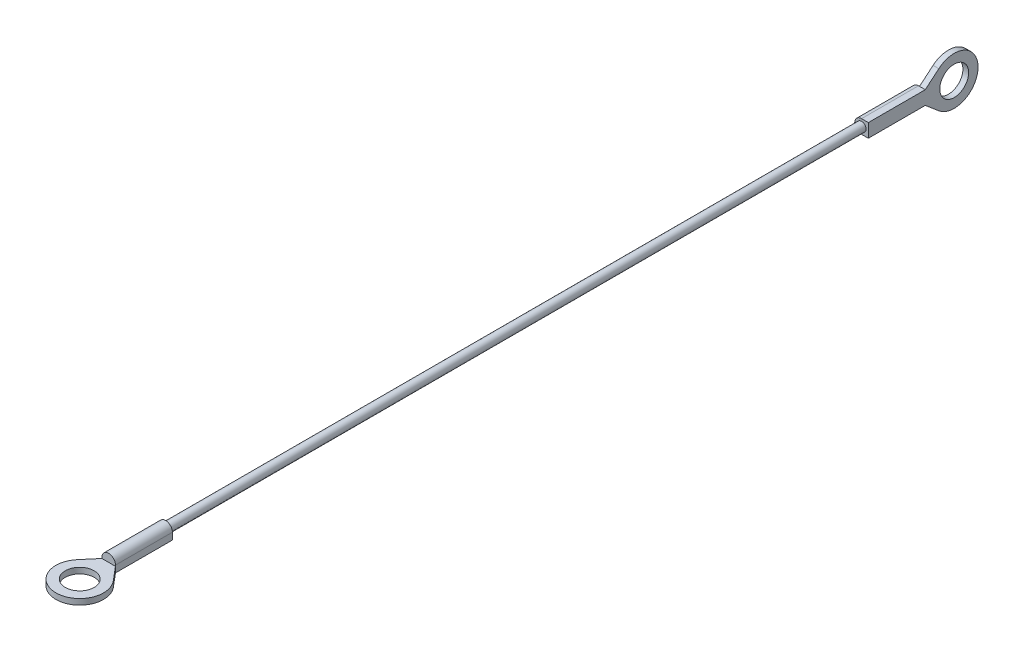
ISO-10303-21;
HEADER;
FILE_DESCRIPTION(('STEP AP214'),'2;1');
FILE_NAME('part.step','',(''),(''),'','','');
FILE_SCHEMA(('AUTOMOTIVE_DESIGN { 1 0 10303 214 1 1 1 1 }'));
ENDSEC;
DATA;
#1=APPLICATION_CONTEXT('core data for automotive mechanical design processes');
#2=APPLICATION_PROTOCOL_DEFINITION('international standard','automotive_design',2000,#1);
#3=PRODUCT_CONTEXT('',#1,'mechanical');
#4=PRODUCT('Part','Part','',(#3));
#5=PRODUCT_RELATED_PRODUCT_CATEGORY('part','',(#4));
#6=PRODUCT_DEFINITION_FORMATION('','',#4);
#7=PRODUCT_DEFINITION_CONTEXT('part definition',#1,'design');
#8=PRODUCT_DEFINITION('design','',#6,#7);
#9=PRODUCT_DEFINITION_SHAPE('','',#8);
#10=(LENGTH_UNIT() NAMED_UNIT(*) SI_UNIT(.MILLI.,.METRE.));
#11=(NAMED_UNIT(*) PLANE_ANGLE_UNIT() SI_UNIT($,.RADIAN.));
#12=(NAMED_UNIT(*) SI_UNIT($,.STERADIAN.) SOLID_ANGLE_UNIT());
#13=UNCERTAINTY_MEASURE_WITH_UNIT(LENGTH_MEASURE(1.E-05),#10,'distance_accuracy_value','');
#14=(GEOMETRIC_REPRESENTATION_CONTEXT(3) GLOBAL_UNCERTAINTY_ASSIGNED_CONTEXT((#13)) GLOBAL_UNIT_ASSIGNED_CONTEXT((#10,
#11,#12)) REPRESENTATION_CONTEXT('',''));
#15=CARTESIAN_POINT('',(0.,0.,0.));
#16=DIRECTION('',(0.,0.,1.));
#17=DIRECTION('',(1.,0.,0.));
#18=AXIS2_PLACEMENT_3D('',#15,#16,#17);
#19=CARTESIAN_POINT('',(0.,0.,-71.12));
#20=DIRECTION('',(0.,0.,-1.));
#21=DIRECTION('',(-1.,0.,0.));
#22=AXIS2_PLACEMENT_3D('',#19,#20,#21);
#23=PLANE('',#22);
#24=DIRECTION('',(1.,0.,0.));
#25=VECTOR('',#24,1.);
#26=CARTESIAN_POINT('',(0.,1.195,-71.12));
#27=LINE('',#26,#25);
#28=CARTESIAN_POINT('',(0.,1.195,-71.12));
#29=VERTEX_POINT('',#28);
#30=CARTESIAN_POINT('',(0.185,1.195,-71.12));
#31=VERTEX_POINT('',#30);
#32=EDGE_CURVE('E196',#29,#31,#27,.T.);
#33=ORIENTED_EDGE('',*,*,#32,.T.);
#34=DIRECTION('',(0.,-1.,0.));
#35=VECTOR('',#34,1.);
#36=CARTESIAN_POINT('',(0.185,-1.195,-71.12));
#37=LINE('',#36,#35);
#38=CARTESIAN_POINT('',(0.185,-1.195,-71.12));
#39=VERTEX_POINT('',#38);
#40=EDGE_CURVE('E154',#31,#39,#37,.T.);
#41=ORIENTED_EDGE('',*,*,#40,.T.);
#42=DIRECTION('',(-1.,0.,0.));
#43=VECTOR('',#42,1.);
#44=CARTESIAN_POINT('',(1.195,-1.195,-71.12));
#45=LINE('',#44,#43);
#46=CARTESIAN_POINT('',(0.,-1.195,-71.12));
#47=VERTEX_POINT('',#46);
#48=EDGE_CURVE('E201',#39,#47,#45,.T.);
#49=ORIENTED_EDGE('',*,*,#48,.T.);
#50=CARTESIAN_POINT('',(0.,0.,-71.12));
#51=DIRECTION('',(0.,0.,-1.));
#52=DIRECTION('',(-1.,0.,0.));
#53=AXIS2_PLACEMENT_3D('',#50,#51,#52);
#54=CIRCLE('',#53,1.195);
#55=EDGE_CURVE('E192',#47,#29,#54,.T.);
#56=ORIENTED_EDGE('',*,*,#55,.T.);
#57=EDGE_LOOP('',(#33,#41,#49,#56));
#58=FACE_BOUND('',#57,.T.);
#59=ADVANCED_FACE('F39',(#58),#23,.T.);
#60=CARTESIAN_POINT('',(0.,0.,71.12));
#61=DIRECTION('',(0.,0.,1.));
#62=DIRECTION('',(1.,0.,0.));
#63=AXIS2_PLACEMENT_3D('',#60,#61,#62);
#64=PLANE('',#63);
#65=DIRECTION('',(0.,-1.,0.));
#66=VECTOR('',#65,1.);
#67=CARTESIAN_POINT('',(-1.195,0.,71.12));
#68=LINE('',#67,#66);
#69=CARTESIAN_POINT('',(-1.195,0.,71.12));
#70=VERTEX_POINT('',#69);
#71=CARTESIAN_POINT('',(-1.195,-0.185,71.12));
#72=VERTEX_POINT('',#71);
#73=EDGE_CURVE('E279',#70,#72,#68,.T.);
#74=ORIENTED_EDGE('',*,*,#73,.T.);
#75=DIRECTION('',(1.,0.,0.));
#76=VECTOR('',#75,1.);
#77=CARTESIAN_POINT('',(-1.195,-0.185,71.12));
#78=LINE('',#77,#76);
#79=CARTESIAN_POINT('',(1.195,-0.185,71.12));
#80=VERTEX_POINT('',#79);
#81=EDGE_CURVE('E241',#72,#80,#78,.T.);
#82=ORIENTED_EDGE('',*,*,#81,.T.);
#83=DIRECTION('',(0.,1.,0.));
#84=VECTOR('',#83,1.);
#85=CARTESIAN_POINT('',(1.195,-1.195,71.12));
#86=LINE('',#85,#84);
#87=CARTESIAN_POINT('',(1.195,0.,71.12));
#88=VERTEX_POINT('',#87);
#89=EDGE_CURVE('E284',#80,#88,#86,.T.);
#90=ORIENTED_EDGE('',*,*,#89,.T.);
#91=CARTESIAN_POINT('',(0.,0.,71.12));
#92=DIRECTION('',(0.,0.,1.));
#93=DIRECTION('',(1.,0.,0.));
#94=AXIS2_PLACEMENT_3D('',#91,#92,#93);
#95=CIRCLE('',#94,1.195);
#96=EDGE_CURVE('E275',#88,#70,#95,.T.);
#97=ORIENTED_EDGE('',*,*,#96,.T.);
#98=EDGE_LOOP('',(#74,#82,#90,#97));
#99=FACE_BOUND('',#98,.T.);
#100=ADVANCED_FACE('F338',(#99),#64,.T.);
#101=CARTESIAN_POINT('',(0.,0.,61.12));
#102=DIRECTION('',(0.,0.,-1.));
#103=DIRECTION('',(-1.,0.,0.));
#104=AXIS2_PLACEMENT_3D('',#101,#102,#103);
#105=CYLINDRICAL_SURFACE('',#104,0.795);
#106=CARTESIAN_POINT('',(0.,0.,61.12));
#107=DIRECTION('',(0.,0.,1.));
#108=DIRECTION('',(1.,0.,0.));
#109=AXIS2_PLACEMENT_3D('',#106,#107,#108);
#110=CIRCLE('',#109,0.795);
#111=CARTESIAN_POINT('',(-0.795,0.,61.12));
#112=VERTEX_POINT('',#111);
#113=EDGE_CURVE('E11',#112,#112,#110,.T.);
#114=CARTESIAN_POINT('',(0.,0.,-61.12));
#115=DIRECTION('',(0.,0.,1.));
#116=DIRECTION('',(1.,0.,0.));
#117=AXIS2_PLACEMENT_3D('',#114,#115,#116);
#118=CIRCLE('',#117,0.795);
#119=CARTESIAN_POINT('',(-0.795,0.,-61.12));
#120=VERTEX_POINT('',#119);
#121=EDGE_CURVE('E43',#120,#120,#118,.T.);
#122=CARTESIAN_POINT('',(-0.795,0.,61.12));
#123=CARTESIAN_POINT('',(-0.795,0.,59.8466666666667));
#124=CARTESIAN_POINT('',(-0.795,0.,58.5733333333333));
#125=CARTESIAN_POINT('',(-0.795,0.,56.0266666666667));
#126=CARTESIAN_POINT('',(-0.795,0.,54.7533333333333));
#127=CARTESIAN_POINT('',(-0.795,0.,52.2066666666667));
#128=CARTESIAN_POINT('',(-0.795,0.,50.9333333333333));
#129=CARTESIAN_POINT('',(-0.795,0.,48.3866666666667));
#130=CARTESIAN_POINT('',(-0.795,0.,47.1133333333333));
#131=CARTESIAN_POINT('',(-0.795,0.,44.5666666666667));
#132=CARTESIAN_POINT('',(-0.795,0.,43.2933333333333));
#133=CARTESIAN_POINT('',(-0.795,0.,40.7466666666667));
#134=CARTESIAN_POINT('',(-0.795,0.,39.4733333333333));
#135=CARTESIAN_POINT('',(-0.795,0.,36.9266666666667));
#136=CARTESIAN_POINT('',(-0.795,0.,35.6533333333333));
#137=CARTESIAN_POINT('',(-0.795,0.,33.1066666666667));
#138=CARTESIAN_POINT('',(-0.795,0.,31.8333333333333));
#139=CARTESIAN_POINT('',(-0.795,0.,29.2866666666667));
#140=CARTESIAN_POINT('',(-0.795,0.,28.0133333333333));
#141=CARTESIAN_POINT('',(-0.795,0.,25.4666666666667));
#142=CARTESIAN_POINT('',(-0.795,0.,24.1933333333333));
#143=CARTESIAN_POINT('',(-0.795,0.,21.6466666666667));
#144=CARTESIAN_POINT('',(-0.795,0.,20.3733333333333));
#145=CARTESIAN_POINT('',(-0.795,0.,17.8266666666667));
#146=CARTESIAN_POINT('',(-0.795,0.,16.5533333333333));
#147=CARTESIAN_POINT('',(-0.795,0.,14.0066666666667));
#148=CARTESIAN_POINT('',(-0.795,0.,12.7333333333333));
#149=CARTESIAN_POINT('',(-0.795,0.,10.1866666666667));
#150=CARTESIAN_POINT('',(-0.795,0.,8.91333333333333));
#151=CARTESIAN_POINT('',(-0.795,0.,6.36666666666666));
#152=CARTESIAN_POINT('',(-0.795,0.,5.09333333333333));
#153=CARTESIAN_POINT('',(-0.795,0.,2.54666666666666));
#154=CARTESIAN_POINT('',(-0.795,0.,1.27333333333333));
#155=CARTESIAN_POINT('',(-0.795,0.,-1.27333333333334));
#156=CARTESIAN_POINT('',(-0.795,0.,-2.54666666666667));
#157=CARTESIAN_POINT('',(-0.795,0.,-5.09333333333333));
#158=CARTESIAN_POINT('',(-0.795,0.,-6.36666666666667));
#159=CARTESIAN_POINT('',(-0.795,0.,-8.91333333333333));
#160=CARTESIAN_POINT('',(-0.795,0.,-10.1866666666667));
#161=CARTESIAN_POINT('',(-0.795,0.,-12.7333333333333));
#162=CARTESIAN_POINT('',(-0.795,0.,-14.0066666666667));
#163=CARTESIAN_POINT('',(-0.795,0.,-16.5533333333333));
#164=CARTESIAN_POINT('',(-0.795,0.,-17.8266666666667));
#165=CARTESIAN_POINT('',(-0.795,0.,-20.3733333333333));
#166=CARTESIAN_POINT('',(-0.795,0.,-21.6466666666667));
#167=CARTESIAN_POINT('',(-0.795,0.,-24.1933333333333));
#168=CARTESIAN_POINT('',(-0.795,0.,-25.4666666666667));
#169=CARTESIAN_POINT('',(-0.795,0.,-28.0133333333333));
#170=CARTESIAN_POINT('',(-0.795,0.,-29.2866666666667));
#171=CARTESIAN_POINT('',(-0.795,0.,-31.8333333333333));
#172=CARTESIAN_POINT('',(-0.795,0.,-33.1066666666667));
#173=CARTESIAN_POINT('',(-0.795,0.,-35.6533333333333));
#174=CARTESIAN_POINT('',(-0.795,0.,-36.9266666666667));
#175=CARTESIAN_POINT('',(-0.795,0.,-39.4733333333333));
#176=CARTESIAN_POINT('',(-0.795,0.,-40.7466666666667));
#177=CARTESIAN_POINT('',(-0.795,0.,-43.2933333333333));
#178=CARTESIAN_POINT('',(-0.795,0.,-44.5666666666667));
#179=CARTESIAN_POINT('',(-0.795,0.,-47.1133333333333));
#180=CARTESIAN_POINT('',(-0.795,0.,-48.3866666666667));
#181=CARTESIAN_POINT('',(-0.795,0.,-50.9333333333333));
#182=CARTESIAN_POINT('',(-0.795,0.,-52.2066666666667));
#183=CARTESIAN_POINT('',(-0.795,0.,-54.7533333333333));
#184=CARTESIAN_POINT('',(-0.795,0.,-56.0266666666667));
#185=CARTESIAN_POINT('',(-0.795,0.,-58.5733333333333));
#186=CARTESIAN_POINT('',(-0.795,0.,-59.8466666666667));
#187=CARTESIAN_POINT('',(-0.795,0.,-61.12));
#188=B_SPLINE_CURVE_WITH_KNOTS('',3,(#122,#123,#124,#125,#126,#127,#128,#129,#130,#131,#132,
#133,#134,#135,#136,#137,#138,#139,#140,#141,#142,#143,#144,#145,#146,#147,#148,#149,#150,#151,
#152,#153,#154,#155,#156,#157,#158,#159,#160,#161,#162,#163,#164,#165,#166,#167,#168,#169,#170,
#171,#172,#173,#174,#175,#176,#177,#178,#179,#180,#181,#182,#183,#184,#185,#186,#187),
.UNSPECIFIED.,.F.,.F.,(4,2,2,2,2,2,2,2,2,2,2,2,2,2,2,2,2,2,2,2,2,2,2,2,2,2,2,2,2,2,2,2,4),(0.,
3.82,7.63999999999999,11.46,15.28,19.1,22.92,26.74,30.56,34.38,38.2,42.02,45.84,49.66,53.48,
57.3,61.12,64.94,68.76,72.58,76.4,80.22,84.04,87.86,91.68,95.5,99.32,103.14,106.96,110.78,114.6,
118.42,122.24),.UNSPECIFIED.);
#189=EDGE_CURVE('BSEAM41',#112,#120,#188,.T.);
#190=ORIENTED_EDGE('',*,*,#113,.F.);
#191=ORIENTED_EDGE('',*,*,#121,.T.);
#192=ORIENTED_EDGE('',*,*,#189,.T.);
#193=ORIENTED_EDGE('',*,*,#189,.F.);
#194=EDGE_LOOP('',(#190,#192,#191,#193));
#195=FACE_BOUND('',#194,.T.);
#196=ADVANCED_FACE('F41',(#195),#105,.T.);
#197=CARTESIAN_POINT('',(0.,0.,71.12));
#198=DIRECTION('',(0.,0.,-1.));
#199=DIRECTION('',(-1.,0.,0.));
#200=AXIS2_PLACEMENT_3D('',#197,#198,#199);
#201=CYLINDRICAL_SURFACE('',#200,1.195);
#202=CARTESIAN_POINT('',(0.,0.,61.12));
#203=DIRECTION('',(0.,0.,1.));
#204=DIRECTION('',(1.,0.,0.));
#205=AXIS2_PLACEMENT_3D('',#202,#203,#204);
#206=CIRCLE('',#205,1.195);
#207=CARTESIAN_POINT('',(1.195,0.,61.12));
#208=VERTEX_POINT('',#207);
#209=CARTESIAN_POINT('',(-1.195,0.,61.12));
#210=VERTEX_POINT('',#209);
#211=EDGE_CURVE('E270',#208,#210,#206,.T.);
#212=ORIENTED_EDGE('',*,*,#211,.T.);
#213=DIRECTION('',(0.,0.,-1.));
#214=VECTOR('',#213,1.);
#215=CARTESIAN_POINT('',(-1.195,0.,71.12));
#216=LINE('',#215,#214);
#217=EDGE_CURVE('E49',#70,#210,#216,.T.);
#218=ORIENTED_EDGE('',*,*,#217,.F.);
#219=ORIENTED_EDGE('',*,*,#96,.F.);
#220=DIRECTION('',(0.,0.,-1.));
#221=VECTOR('',#220,1.);
#222=CARTESIAN_POINT('',(1.195,0.,71.12));
#223=LINE('',#222,#221);
#224=EDGE_CURVE('E288',#88,#208,#223,.T.);
#225=ORIENTED_EDGE('',*,*,#224,.T.);
#226=EDGE_LOOP('',(#212,#218,#219,#225));
#227=FACE_BOUND('',#226,.T.);
#228=ADVANCED_FACE('F322',(#227),#201,.T.);
#229=CARTESIAN_POINT('',(-1.195,0.,71.12));
#230=DIRECTION('',(1.,0.,0.));
#231=DIRECTION('',(0.,1.,0.));
#232=AXIS2_PLACEMENT_3D('',#229,#230,#231);
#233=PLANE('',#232);
#234=DIRECTION('',(0.,-1.,0.));
#235=VECTOR('',#234,1.);
#236=CARTESIAN_POINT('',(-1.195,0.,61.12));
#237=LINE('',#236,#235);
#238=CARTESIAN_POINT('',(-1.195,-1.195,61.12));
#239=VERTEX_POINT('',#238);
#240=EDGE_CURVE('E292',#210,#239,#237,.T.);
#241=ORIENTED_EDGE('',*,*,#240,.T.);
#242=DIRECTION('',(0.,0.,-1.));
#243=VECTOR('',#242,1.);
#244=CARTESIAN_POINT('',(-1.195,-1.195,71.12));
#245=LINE('',#244,#243);
#246=CARTESIAN_POINT('',(-1.195,-1.195,71.12));
#247=VERTEX_POINT('',#246);
#248=EDGE_CURVE('E308',#247,#239,#245,.T.);
#249=ORIENTED_EDGE('',*,*,#248,.F.);
#250=DIRECTION('',(0.,-1.,0.));
#251=VECTOR('',#250,1.);
#252=CARTESIAN_POINT('',(-1.195,-0.185,71.12));
#253=LINE('',#252,#251);
#254=EDGE_CURVE('E267',#72,#247,#253,.T.);
#255=ORIENTED_EDGE('',*,*,#254,.F.);
#256=ORIENTED_EDGE('',*,*,#73,.F.);
#257=ORIENTED_EDGE('',*,*,#217,.T.);
#258=EDGE_LOOP('',(#241,#249,#255,#256,#257));
#259=FACE_BOUND('',#258,.T.);
#260=ADVANCED_FACE('F316',(#259),#233,.F.);
#261=CARTESIAN_POINT('',(0.,-1.195,71.12));
#262=DIRECTION('',(0.,1.,0.));
#263=DIRECTION('',(0.,0.,1.));
#264=AXIS2_PLACEMENT_3D('',#261,#262,#263);
#265=PLANE('',#264);
#266=DIRECTION('',(1.,0.,0.));
#267=VECTOR('',#266,1.);
#268=CARTESIAN_POINT('',(0.,-1.195,61.12));
#269=LINE('',#268,#267);
#270=CARTESIAN_POINT('',(1.195,-1.195,61.12));
#271=VERTEX_POINT('',#270);
#272=EDGE_CURVE('E296',#239,#271,#269,.T.);
#273=ORIENTED_EDGE('',*,*,#272,.T.);
#274=DIRECTION('',(0.,0.,-1.));
#275=VECTOR('',#274,1.);
#276=CARTESIAN_POINT('',(1.195,-1.195,71.12));
#277=LINE('',#276,#275);
#278=CARTESIAN_POINT('',(1.195,-1.195,71.12));
#279=VERTEX_POINT('',#278);
#280=EDGE_CURVE('E304',#279,#271,#277,.T.);
#281=ORIENTED_EDGE('',*,*,#280,.F.);
#282=DIRECTION('',(0.645049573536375,0.,0.764140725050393));
#283=VECTOR('',#282,1.);
#284=CARTESIAN_POINT('',(1.195,-1.195,71.12));
#285=LINE('',#284,#283);
#286=CARTESIAN_POINT('',(3.20174963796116,-1.195,73.4972422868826));
#287=VERTEX_POINT('',#286);
#288=EDGE_CURVE('E236',#279,#287,#285,.T.);
#289=ORIENTED_EDGE('',*,*,#288,.T.);
#290=CARTESIAN_POINT('',(0.,-1.195,76.2));
#291=DIRECTION('',(0.,-1.,0.));
#292=DIRECTION('',(0.,0.,-1.));
#293=AXIS2_PLACEMENT_3D('',#290,#291,#292);
#294=CIRCLE('',#293,4.19000000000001);
#295=CARTESIAN_POINT('',(-3.20174963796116,-1.195,73.4972422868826));
#296=VERTEX_POINT('',#295);
#297=EDGE_CURVE('E260',#287,#296,#294,.T.);
#298=ORIENTED_EDGE('',*,*,#297,.T.);
#299=DIRECTION('',(0.645049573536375,0.,-0.764140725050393));
#300=VECTOR('',#299,1.);
#301=CARTESIAN_POINT('',(-3.20174963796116,-1.195,73.4972422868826));
#302=LINE('',#301,#300);
#303=EDGE_CURVE('E245',#296,#247,#302,.T.);
#304=ORIENTED_EDGE('',*,*,#303,.T.);
#305=ORIENTED_EDGE('',*,*,#248,.T.);
#306=EDGE_LOOP('',(#273,#281,#289,#298,#304,#305));
#307=FACE_BOUND('',#306,.T.);
#308=CARTESIAN_POINT('',(0.,-1.195,76.2));
#309=DIRECTION('',(0.,-1.,0.));
#310=DIRECTION('',(0.,0.,-1.));
#311=AXIS2_PLACEMENT_3D('',#308,#309,#310);
#312=CIRCLE('',#311,2.54);
#313=CARTESIAN_POINT('',(0.,-1.195,73.66));
#314=VERTEX_POINT('',#313);
#315=EDGE_CURVE('E237',#314,#314,#312,.T.);
#316=ORIENTED_EDGE('',*,*,#315,.F.);
#317=EDGE_LOOP('',(#316));
#318=FACE_BOUND('',#317,.T.);
#319=ADVANCED_FACE('F329',(#307,#318),#265,.F.);
#320=CARTESIAN_POINT('',(1.195,-1.195,71.12));
#321=DIRECTION('',(-1.,0.,0.));
#322=DIRECTION('',(0.,-1.,0.));
#323=AXIS2_PLACEMENT_3D('',#320,#321,#322);
#324=PLANE('',#323);
#325=DIRECTION('',(0.,1.,0.));
#326=VECTOR('',#325,1.);
#327=CARTESIAN_POINT('',(1.195,-1.195,61.12));
#328=LINE('',#327,#326);
#329=EDGE_CURVE('E280',#271,#208,#328,.T.);
#330=ORIENTED_EDGE('',*,*,#329,.T.);
#331=ORIENTED_EDGE('',*,*,#224,.F.);
#332=ORIENTED_EDGE('',*,*,#89,.F.);
#333=EDGE_CURVE('E285',#279,#80,#86,.T.);
#334=ORIENTED_EDGE('',*,*,#333,.F.);
#335=ORIENTED_EDGE('',*,*,#280,.T.);
#336=EDGE_LOOP('',(#330,#331,#332,#334,#335));
#337=FACE_BOUND('',#336,.T.);
#338=ADVANCED_FACE('F333',(#337),#324,.F.);
#339=CARTESIAN_POINT('',(0.,0.,61.12));
#340=DIRECTION('',(0.,0.,1.));
#341=DIRECTION('',(1.,0.,0.));
#342=AXIS2_PLACEMENT_3D('',#339,#340,#341);
#343=PLANE('',#342);
#344=ORIENTED_EDGE('',*,*,#113,.T.);
#345=EDGE_LOOP('',(#344));
#346=FACE_BOUND('',#345,.T.);
#347=ORIENTED_EDGE('',*,*,#211,.F.);
#348=ORIENTED_EDGE('',*,*,#329,.F.);
#349=ORIENTED_EDGE('',*,*,#272,.F.);
#350=ORIENTED_EDGE('',*,*,#240,.F.);
#351=EDGE_LOOP('',(#347,#348,#349,#350));
#352=FACE_BOUND('',#351,.T.);
#353=ADVANCED_FACE('F326',(#346,#352),#343,.F.);
#354=CARTESIAN_POINT('',(-3.20174963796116,-0.185,73.4972422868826));
#355=DIRECTION('',(-0.764140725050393,0.,-0.645049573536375));
#356=DIRECTION('',(-0.645049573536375,0.,0.764140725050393));
#357=AXIS2_PLACEMENT_3D('',#354,#355,#356);
#358=PLANE('',#357);
#359=ORIENTED_EDGE('',*,*,#303,.F.);
#360=DIRECTION('',(0.,-1.,0.));
#361=VECTOR('',#360,1.);
#362=CARTESIAN_POINT('',(-3.20174963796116,-0.185,73.4972422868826));
#363=LINE('',#362,#361);
#364=CARTESIAN_POINT('',(-3.20174963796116,-0.185,73.4972422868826));
#365=VERTEX_POINT('',#364);
#366=EDGE_CURVE('E271',#365,#296,#363,.T.);
#367=ORIENTED_EDGE('',*,*,#366,.F.);
#368=DIRECTION('',(0.645049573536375,0.,-0.764140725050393));
#369=VECTOR('',#368,1.);
#370=CARTESIAN_POINT('',(-3.20174963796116,-0.185,73.4972422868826));
#371=LINE('',#370,#369);
#372=EDGE_CURVE('E252',#365,#72,#371,.T.);
#373=ORIENTED_EDGE('',*,*,#372,.T.);
#374=ORIENTED_EDGE('',*,*,#254,.T.);
#375=EDGE_LOOP('',(#359,#367,#373,#374));
#376=FACE_BOUND('',#375,.T.);
#377=ADVANCED_FACE('F343',(#376),#358,.T.);
#378=CARTESIAN_POINT('',(0.,-0.185,76.2));
#379=DIRECTION('',(0.,-1.,0.));
#380=DIRECTION('',(0.,0.,-1.));
#381=AXIS2_PLACEMENT_3D('',#378,#379,#380);
#382=CYLINDRICAL_SURFACE('',#381,4.19000000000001);
#383=ORIENTED_EDGE('',*,*,#297,.F.);
#384=DIRECTION('',(0.,-1.,0.));
#385=VECTOR('',#384,1.);
#386=CARTESIAN_POINT('',(3.20174963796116,-0.185,73.4972422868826));
#387=LINE('',#386,#385);
#388=CARTESIAN_POINT('',(3.20174963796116,-0.185,73.4972422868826));
#389=VERTEX_POINT('',#388);
#390=EDGE_CURVE('E256',#389,#287,#387,.T.);
#391=ORIENTED_EDGE('',*,*,#390,.F.);
#392=CARTESIAN_POINT('',(0.,-0.185,76.2));
#393=DIRECTION('',(0.,-1.,0.));
#394=DIRECTION('',(0.,0.,-1.));
#395=AXIS2_PLACEMENT_3D('',#392,#393,#394);
#396=CIRCLE('',#395,4.19000000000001);
#397=EDGE_CURVE('E248',#389,#365,#396,.T.);
#398=ORIENTED_EDGE('',*,*,#397,.T.);
#399=ORIENTED_EDGE('',*,*,#366,.T.);
#400=EDGE_LOOP('',(#383,#391,#398,#399));
#401=FACE_BOUND('',#400,.T.);
#402=ADVANCED_FACE('F346',(#401),#382,.T.);
#403=CARTESIAN_POINT('',(1.195,-0.185,71.12));
#404=DIRECTION('',(0.764140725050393,0.,-0.645049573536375));
#405=DIRECTION('',(-0.645049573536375,0.,-0.764140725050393));
#406=AXIS2_PLACEMENT_3D('',#403,#404,#405);
#407=PLANE('',#406);
#408=ORIENTED_EDGE('',*,*,#288,.F.);
#409=ORIENTED_EDGE('',*,*,#333,.T.);
#410=DIRECTION('',(0.645049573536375,0.,0.764140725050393));
#411=VECTOR('',#410,1.);
#412=CARTESIAN_POINT('',(1.195,-0.185,71.12));
#413=LINE('',#412,#411);
#414=EDGE_CURVE('E64',#80,#389,#413,.T.);
#415=ORIENTED_EDGE('',*,*,#414,.T.);
#416=ORIENTED_EDGE('',*,*,#390,.T.);
#417=EDGE_LOOP('',(#408,#409,#415,#416));
#418=FACE_BOUND('',#417,.T.);
#419=ADVANCED_FACE('F336',(#418),#407,.T.);
#420=CARTESIAN_POINT('',(0.,-0.185,76.2));
#421=DIRECTION('',(0.,-1.,0.));
#422=DIRECTION('',(0.,0.,-1.));
#423=AXIS2_PLACEMENT_3D('',#420,#421,#422);
#424=PLANE('',#423);
#425=CARTESIAN_POINT('',(0.,-0.185,76.2));
#426=DIRECTION('',(0.,-1.,0.));
#427=DIRECTION('',(0.,0.,-1.));
#428=AXIS2_PLACEMENT_3D('',#425,#426,#427);
#429=CIRCLE('',#428,2.54);
#430=CARTESIAN_POINT('',(0.,-0.185,73.66));
#431=VERTEX_POINT('',#430);
#432=EDGE_CURVE('E232',#431,#431,#429,.T.);
#433=ORIENTED_EDGE('',*,*,#432,.T.);
#434=EDGE_LOOP('',(#433));
#435=FACE_BOUND('',#434,.T.);
#436=ORIENTED_EDGE('',*,*,#81,.F.);
#437=ORIENTED_EDGE('',*,*,#372,.F.);
#438=ORIENTED_EDGE('',*,*,#397,.F.);
#439=ORIENTED_EDGE('',*,*,#414,.F.);
#440=EDGE_LOOP('',(#436,#437,#438,#439));
#441=FACE_BOUND('',#440,.T.);
#442=ADVANCED_FACE('F340',(#435,#441),#424,.F.);
#443=CARTESIAN_POINT('',(0.,-0.185,76.2));
#444=DIRECTION('',(0.,-1.,0.));
#445=DIRECTION('',(0.,0.,-1.));
#446=AXIS2_PLACEMENT_3D('',#443,#444,#445);
#447=CYLINDRICAL_SURFACE('',#446,2.54);
#448=ORIENTED_EDGE('',*,*,#432,.F.);
#449=EDGE_LOOP('',(#448));
#450=FACE_BOUND('',#449,.T.);
#451=ORIENTED_EDGE('',*,*,#315,.T.);
#452=EDGE_LOOP('',(#451));
#453=FACE_BOUND('',#452,.T.);
#454=ADVANCED_FACE('F384',(#450,#453),#447,.F.);
#455=CARTESIAN_POINT('',(0.,0.,-71.12));
#456=DIRECTION('',(0.,0.,1.));
#457=DIRECTION('',(1.,0.,0.));
#458=AXIS2_PLACEMENT_3D('',#455,#456,#457);
#459=CYLINDRICAL_SURFACE('',#458,1.195);
#460=CARTESIAN_POINT('',(0.,0.,-61.12));
#461=DIRECTION('',(0.,0.,-1.));
#462=DIRECTION('',(-1.,0.,0.));
#463=AXIS2_PLACEMENT_3D('',#460,#461,#462);
#464=CIRCLE('',#463,1.195);
#465=CARTESIAN_POINT('',(0.,-1.195,-61.12));
#466=VERTEX_POINT('',#465);
#467=CARTESIAN_POINT('',(0.,1.195,-61.12));
#468=VERTEX_POINT('',#467);
#469=EDGE_CURVE('E189',#466,#468,#464,.T.);
#470=ORIENTED_EDGE('',*,*,#469,.T.);
#471=DIRECTION('',(0.,0.,1.));
#472=VECTOR('',#471,1.);
#473=CARTESIAN_POINT('',(0.,1.195,-71.12));
#474=LINE('',#473,#472);
#475=EDGE_CURVE('E228',#29,#468,#474,.T.);
#476=ORIENTED_EDGE('',*,*,#475,.F.);
#477=ORIENTED_EDGE('',*,*,#55,.F.);
#478=DIRECTION('',(0.,0.,1.));
#479=VECTOR('',#478,1.);
#480=CARTESIAN_POINT('',(0.,-1.195,-71.12));
#481=LINE('',#480,#479);
#482=EDGE_CURVE('E204',#47,#466,#481,.T.);
#483=ORIENTED_EDGE('',*,*,#482,.T.);
#484=EDGE_LOOP('',(#470,#476,#477,#483));
#485=FACE_BOUND('',#484,.T.);
#486=ADVANCED_FACE('F380',(#485),#459,.T.);
#487=CARTESIAN_POINT('',(0.,1.195,-71.12));
#488=DIRECTION('',(0.,-1.,0.));
#489=DIRECTION('',(0.,0.,-1.));
#490=AXIS2_PLACEMENT_3D('',#487,#488,#489);
#491=PLANE('',#490);
#492=DIRECTION('',(1.,0.,0.));
#493=VECTOR('',#492,1.);
#494=CARTESIAN_POINT('',(0.,1.195,-61.12));
#495=LINE('',#494,#493);
#496=CARTESIAN_POINT('',(1.195,1.195,-61.12));
#497=VERTEX_POINT('',#496);
#498=EDGE_CURVE('E208',#468,#497,#495,.T.);
#499=ORIENTED_EDGE('',*,*,#498,.T.);
#500=DIRECTION('',(0.,0.,1.));
#501=VECTOR('',#500,1.);
#502=CARTESIAN_POINT('',(1.195,1.195,-71.12));
#503=LINE('',#502,#501);
#504=CARTESIAN_POINT('',(1.195,1.195,-71.12));
#505=VERTEX_POINT('',#504);
#506=EDGE_CURVE('E224',#505,#497,#503,.T.);
#507=ORIENTED_EDGE('',*,*,#506,.F.);
#508=DIRECTION('',(1.,0.,0.));
#509=VECTOR('',#508,1.);
#510=CARTESIAN_POINT('',(0.185,1.195,-71.12));
#511=LINE('',#510,#509);
#512=EDGE_CURVE('E186',#31,#505,#511,.T.);
#513=ORIENTED_EDGE('',*,*,#512,.F.);
#514=ORIENTED_EDGE('',*,*,#32,.F.);
#515=ORIENTED_EDGE('',*,*,#475,.T.);
#516=EDGE_LOOP('',(#499,#507,#513,#514,#515));
#517=FACE_BOUND('',#516,.T.);
#518=ADVANCED_FACE('F376',(#517),#491,.F.);
#519=CARTESIAN_POINT('',(1.195,0.,-71.12));
#520=DIRECTION('',(-1.,0.,0.));
#521=DIRECTION('',(0.,-1.,0.));
#522=AXIS2_PLACEMENT_3D('',#519,#520,#521);
#523=PLANE('',#522);
#524=DIRECTION('',(0.,-1.,0.));
#525=VECTOR('',#524,1.);
#526=CARTESIAN_POINT('',(1.195,0.,-61.12));
#527=LINE('',#526,#525);
#528=CARTESIAN_POINT('',(1.195,-1.195,-61.12));
#529=VERTEX_POINT('',#528);
#530=EDGE_CURVE('E212',#497,#529,#527,.T.);
#531=ORIENTED_EDGE('',*,*,#530,.T.);
#532=DIRECTION('',(0.,0.,1.));
#533=VECTOR('',#532,1.);
#534=CARTESIAN_POINT('',(1.195,-1.195,-71.12));
#535=LINE('',#534,#533);
#536=CARTESIAN_POINT('',(1.195,-1.195,-71.12));
#537=VERTEX_POINT('',#536);
#538=EDGE_CURVE('E220',#537,#529,#535,.T.);
#539=ORIENTED_EDGE('',*,*,#538,.F.);
#540=DIRECTION('',(0.,-0.645049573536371,-0.764140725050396));
#541=VECTOR('',#540,1.);
#542=CARTESIAN_POINT('',(1.195,-3.20174963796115,-73.4972422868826));
#543=LINE('',#542,#541);
#544=CARTESIAN_POINT('',(1.195,-3.20174963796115,-73.4972422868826));
#545=VERTEX_POINT('',#544);
#546=EDGE_CURVE('E180',#537,#545,#543,.T.);
#547=ORIENTED_EDGE('',*,*,#546,.T.);
#548=CARTESIAN_POINT('',(1.195,0.,-76.2));
#549=DIRECTION('',(1.,0.,0.));
#550=DIRECTION('',(0.,0.,1.));
#551=AXIS2_PLACEMENT_3D('',#548,#549,#550);
#552=CIRCLE('',#551,4.18999999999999);
#553=CARTESIAN_POINT('',(1.195,3.20174963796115,-73.4972422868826));
#554=VERTEX_POINT('',#553);
#555=EDGE_CURVE('E149',#545,#554,#552,.T.);
#556=ORIENTED_EDGE('',*,*,#555,.T.);
#557=DIRECTION('',(0.,-0.645049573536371,0.764140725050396));
#558=VECTOR('',#557,1.);
#559=CARTESIAN_POINT('',(1.195,1.195,-71.12));
#560=LINE('',#559,#558);
#561=EDGE_CURVE('E166',#554,#505,#560,.T.);
#562=ORIENTED_EDGE('',*,*,#561,.T.);
#563=ORIENTED_EDGE('',*,*,#506,.T.);
#564=EDGE_LOOP('',(#531,#539,#547,#556,#562,#563));
#565=FACE_BOUND('',#564,.T.);
#566=CARTESIAN_POINT('',(1.195,0.,-76.2));
#567=DIRECTION('',(1.,0.,0.));
#568=DIRECTION('',(0.,0.,-1.));
#569=AXIS2_PLACEMENT_3D('',#566,#567,#568);
#570=CIRCLE('',#569,2.54);
#571=CARTESIAN_POINT('',(1.195,0.,-78.74));
#572=VERTEX_POINT('',#571);
#573=EDGE_CURVE('E174',#572,#572,#570,.T.);
#574=ORIENTED_EDGE('',*,*,#573,.F.);
#575=EDGE_LOOP('',(#574));
#576=FACE_BOUND('',#575,.T.);
#577=ADVANCED_FACE('F372',(#565,#576),#523,.F.);
#578=CARTESIAN_POINT('',(1.195,-1.195,-71.12));
#579=DIRECTION('',(0.,1.,0.));
#580=DIRECTION('',(0.,0.,1.));
#581=AXIS2_PLACEMENT_3D('',#578,#579,#580);
#582=PLANE('',#581);
#583=DIRECTION('',(-1.,0.,0.));
#584=VECTOR('',#583,1.);
#585=CARTESIAN_POINT('',(1.195,-1.195,-61.12));
#586=LINE('',#585,#584);
#587=EDGE_CURVE('E197',#529,#466,#586,.T.);
#588=ORIENTED_EDGE('',*,*,#587,.T.);
#589=ORIENTED_EDGE('',*,*,#482,.F.);
#590=ORIENTED_EDGE('',*,*,#48,.F.);
#591=EDGE_CURVE('E163',#537,#39,#45,.T.);
#592=ORIENTED_EDGE('',*,*,#591,.F.);
#593=ORIENTED_EDGE('',*,*,#538,.T.);
#594=EDGE_LOOP('',(#588,#589,#590,#592,#593));
#595=FACE_BOUND('',#594,.T.);
#596=ADVANCED_FACE('F368',(#595),#582,.F.);
#597=CARTESIAN_POINT('',(0.,0.,-61.12));
#598=DIRECTION('',(0.,0.,-1.));
#599=DIRECTION('',(-1.,0.,0.));
#600=AXIS2_PLACEMENT_3D('',#597,#598,#599);
#601=PLANE('',#600);
#602=ORIENTED_EDGE('',*,*,#121,.F.);
#603=EDGE_LOOP('',(#602));
#604=FACE_BOUND('',#603,.T.);
#605=ORIENTED_EDGE('',*,*,#469,.F.);
#606=ORIENTED_EDGE('',*,*,#587,.F.);
#607=ORIENTED_EDGE('',*,*,#530,.F.);
#608=ORIENTED_EDGE('',*,*,#498,.F.);
#609=EDGE_LOOP('',(#605,#606,#607,#608));
#610=FACE_BOUND('',#609,.T.);
#611=ADVANCED_FACE('F365',(#604,#610),#601,.F.);
#612=CARTESIAN_POINT('',(0.185,-3.20174963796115,-73.4972422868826));
#613=DIRECTION('',(0.,-0.764140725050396,0.645049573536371));
#614=DIRECTION('',(0.,-0.645049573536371,-0.764140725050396));
#615=AXIS2_PLACEMENT_3D('',#612,#613,#614);
#616=PLANE('',#615);
#617=ORIENTED_EDGE('',*,*,#546,.F.);
#618=ORIENTED_EDGE('',*,*,#591,.T.);
#619=DIRECTION('',(0.,-0.645049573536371,-0.764140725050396));
#620=VECTOR('',#619,1.);
#621=CARTESIAN_POINT('',(0.185,-3.20174963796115,-73.4972422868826));
#622=LINE('',#621,#620);
#623=CARTESIAN_POINT('',(0.185,-3.20174963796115,-73.4972422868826));
#624=VERTEX_POINT('',#623);
#625=EDGE_CURVE('E56',#39,#624,#622,.T.);
#626=ORIENTED_EDGE('',*,*,#625,.T.);
#627=DIRECTION('',(1.,0.,0.));
#628=VECTOR('',#627,1.);
#629=CARTESIAN_POINT('',(0.185,-3.20174963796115,-73.4972422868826));
#630=LINE('',#629,#628);
#631=EDGE_CURVE('E145',#624,#545,#630,.T.);
#632=ORIENTED_EDGE('',*,*,#631,.T.);
#633=EDGE_LOOP('',(#617,#618,#626,#632));
#634=FACE_BOUND('',#633,.T.);
#635=ADVANCED_FACE('F161',(#634),#616,.T.);
#636=CARTESIAN_POINT('',(0.185,1.195,-71.12));
#637=DIRECTION('',(0.,0.764140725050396,0.645049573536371));
#638=DIRECTION('',(0.,-0.645049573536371,0.764140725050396));
#639=AXIS2_PLACEMENT_3D('',#636,#637,#638);
#640=PLANE('',#639);
#641=ORIENTED_EDGE('',*,*,#561,.F.);
#642=DIRECTION('',(1.,0.,0.));
#643=VECTOR('',#642,1.);
#644=CARTESIAN_POINT('',(0.185,3.20174963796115,-73.4972422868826));
#645=LINE('',#644,#643);
#646=CARTESIAN_POINT('',(0.185,3.20174963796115,-73.4972422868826));
#647=VERTEX_POINT('',#646);
#648=EDGE_CURVE('E153',#647,#554,#645,.T.);
#649=ORIENTED_EDGE('',*,*,#648,.F.);
#650=DIRECTION('',(0.,-0.645049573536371,0.764140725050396));
#651=VECTOR('',#650,1.);
#652=CARTESIAN_POINT('',(0.185,1.195,-71.12));
#653=LINE('',#652,#651);
#654=EDGE_CURVE('E158',#647,#31,#653,.T.);
#655=ORIENTED_EDGE('',*,*,#654,.T.);
#656=ORIENTED_EDGE('',*,*,#512,.T.);
#657=EDGE_LOOP('',(#641,#649,#655,#656));
#658=FACE_BOUND('',#657,.T.);
#659=ADVANCED_FACE('F436',(#658),#640,.T.);
#660=CARTESIAN_POINT('',(0.185,0.,-76.2));
#661=DIRECTION('',(1.,0.,0.));
#662=DIRECTION('',(0.,0.,-1.));
#663=AXIS2_PLACEMENT_3D('',#660,#661,#662);
#664=CYLINDRICAL_SURFACE('',#663,4.18999999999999);
#665=ORIENTED_EDGE('',*,*,#555,.F.);
#666=ORIENTED_EDGE('',*,*,#631,.F.);
#667=CARTESIAN_POINT('',(0.185,0.,-76.2));
#668=DIRECTION('',(1.,0.,0.));
#669=DIRECTION('',(0.,0.,1.));
#670=AXIS2_PLACEMENT_3D('',#667,#668,#669);
#671=CIRCLE('',#670,4.18999999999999);
#672=EDGE_CURVE('E147',#624,#647,#671,.T.);
#673=ORIENTED_EDGE('',*,*,#672,.T.);
#674=ORIENTED_EDGE('',*,*,#648,.T.);
#675=EDGE_LOOP('',(#665,#666,#673,#674));
#676=FACE_BOUND('',#675,.T.);
#677=ADVANCED_FACE('F146',(#676),#664,.T.);
#678=CARTESIAN_POINT('',(0.185,0.,-76.2));
#679=DIRECTION('',(-1.,0.,0.));
#680=DIRECTION('',(0.,0.,1.));
#681=AXIS2_PLACEMENT_3D('',#678,#679,#680);
#682=PLANE('',#681);
#683=CARTESIAN_POINT('',(0.185,0.,-76.2));
#684=DIRECTION('',(1.,0.,0.));
#685=DIRECTION('',(0.,0.,-1.));
#686=AXIS2_PLACEMENT_3D('',#683,#684,#685);
#687=CIRCLE('',#686,2.54);
#688=CARTESIAN_POINT('',(0.185,0.,-78.74));
#689=VERTEX_POINT('',#688);
#690=EDGE_CURVE('E183',#689,#689,#687,.T.);
#691=ORIENTED_EDGE('',*,*,#690,.T.);
#692=EDGE_LOOP('',(#691));
#693=FACE_BOUND('',#692,.T.);
#694=ORIENTED_EDGE('',*,*,#625,.F.);
#695=ORIENTED_EDGE('',*,*,#40,.F.);
#696=ORIENTED_EDGE('',*,*,#654,.F.);
#697=ORIENTED_EDGE('',*,*,#672,.F.);
#698=EDGE_LOOP('',(#694,#695,#696,#697));
#699=FACE_BOUND('',#698,.T.);
#700=ADVANCED_FACE('F157',(#693,#699),#682,.T.);
#701=CARTESIAN_POINT('',(0.185,0.,-76.2));
#702=DIRECTION('',(1.,0.,0.));
#703=DIRECTION('',(0.,0.,-1.));
#704=AXIS2_PLACEMENT_3D('',#701,#702,#703);
#705=CYLINDRICAL_SURFACE('',#704,2.54);
#706=ORIENTED_EDGE('',*,*,#690,.F.);
#707=EDGE_LOOP('',(#706));
#708=FACE_BOUND('',#707,.T.);
#709=ORIENTED_EDGE('',*,*,#573,.T.);
#710=EDGE_LOOP('',(#709));
#711=FACE_BOUND('',#710,.T.);
#712=ADVANCED_FACE('F426',(#708,#711),#705,.F.);
#713=CLOSED_SHELL('',(#59,#100,#196,#228,#260,#319,#338,#353,#377,#402,#419,#442,#454,#486,#518,
#577,#596,#611,#635,#659,#677,#700,#712));
#714=MANIFOLD_SOLID_BREP('B2',#713);
#715=ADVANCED_BREP_SHAPE_REPRESENTATION('',(#18,#714),#14);
#716=SHAPE_DEFINITION_REPRESENTATION(#9,#715);
ENDSEC;
END-ISO-10303-21;
